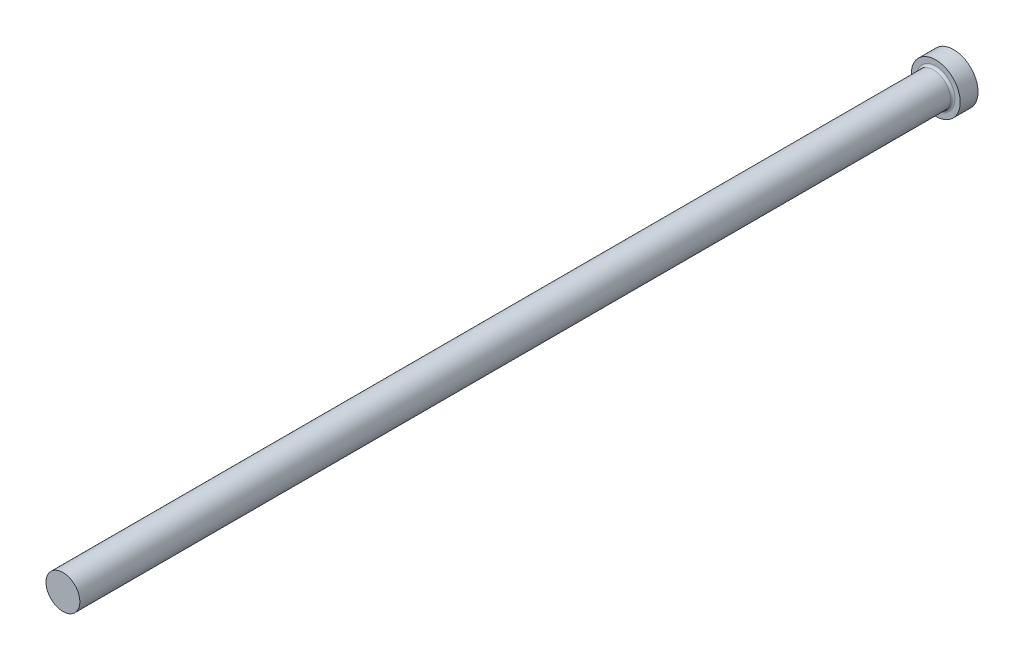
from build123d import *

# Parameters (mm, degrees)
FILLET1_R = 0.5


with BuildPart() as part:
    # FV → Revolve1 (revolve)
    with BuildSketch(Plane(origin=(0, 0, 0), x_dir=(1, 0, 0), z_dir=(0, 1, 0)), mode=Mode.PRIVATE) as revolve1_sk:
        Polygon((0, 0), (5.5, 0), (5.5, -4), (3.8, -4), (3.8, -200), (0, -200), align=None)
    revolve(revolve1_sk.sketch.rotate(Axis((0, 0, -9.033228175), (0, 0, 1)), 180), axis=Axis((0, 0, -9.033228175), (0, 0, 1)))

    # Fillet1
    fillet1_edges = [part.edges().sort_by_distance(p)[0] for p in [
        (3.8, 0, 4),
    ]]
    fillet(fillet1_edges, radius=FILLET1_R)


solid = part.part
